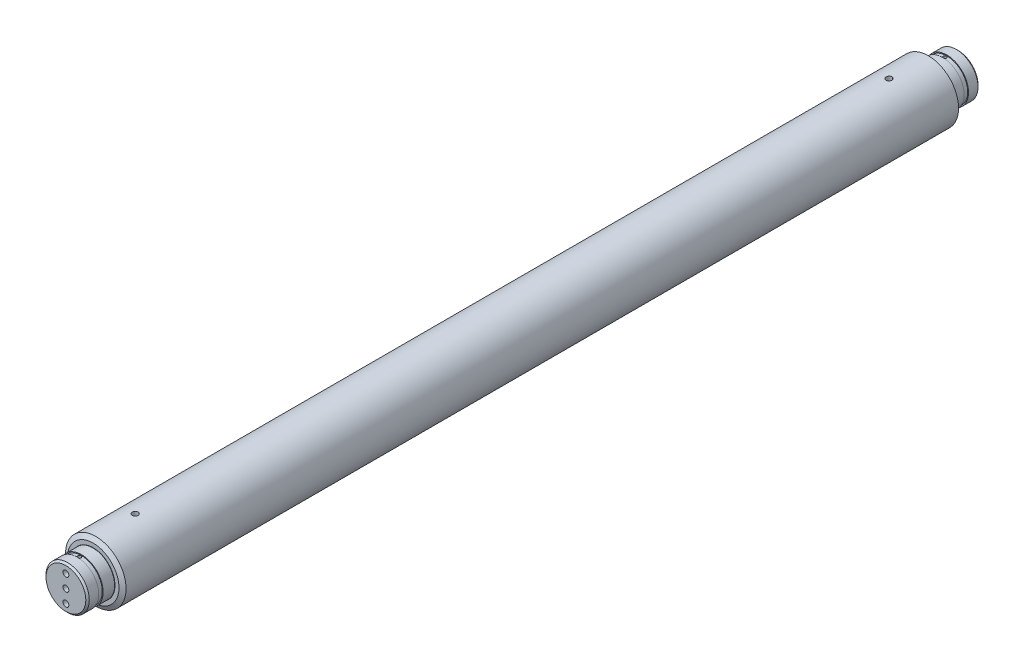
from build123d import *

# Parameters (mm, degrees)
ESQUISSE1_R                  = 35
EXTRUSION1_DEPTH             = 484
CHANFREIN1_SIZE              = 3
CHANFREIN1_SIZE2             = 5.196152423
CHANFREIN3_SIZE              = 3
CHANFREIN3_SIZE2             = 5.196152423
CHANFREIN2_SIZE              = 2
CHANFREIN2_OF_SYM_TRIE1_SIZE = 2
TROU_TARAUD_M82_REACH        = 523.407
TROU_TARAUD_M82_BORE_R       = 3.4
D_GAGEMENT_M3_51_REACH       = 523.407
D_GAGEMENT_M3_51_BORE_R      = 2
TROU_TARAUD_M83_AT_2_COUNT   = 2
TROU_TARAUD_M83_AT_2_PITCH   = 30
CONG_1_R                     = 0.2


with BuildPart() as part:
    # Esquisse1 → Extrusion1 (new, symmetric)
    with BuildSketch(Plane.XY):
        Circle(ESQUISSE1_R)
    extrude(amount=EXTRUSION1_DEPTH, both=True)

    # Chanfrein1
    chanfrein1_edges = [part.edges().sort_by_distance(p)[0] for p in [
        (-35, 0, 484),
    ]]
    chanfrein1_side = [part.faces().sort_by_distance(p)[0] for p in [
        (-35, 0, 0),
    ]]
    chamfer(chanfrein1_edges, length=CHANFREIN1_SIZE, length2=CHANFREIN1_SIZE2, reference=chanfrein1_side[0])

    # Chanfrein3
    chanfrein3_edges = [part.edges().sort_by_distance(p)[0] for p in [
        (-35, 0, -484),
    ]]
    chanfrein3_side = [part.faces().sort_by_distance(p)[0] for p in [
        (-35, 0, -1.5),
    ]]
    chamfer(chanfrein3_edges, length=CHANFREIN3_SIZE, length2=CHANFREIN3_SIZE2, reference=chanfrein3_side[0])

    # Esquisse2 → R_volution1 (revolve)
    with BuildSketch(Plane(origin=(0, 0, 0), x_dir=(0, 0, -1), z_dir=(1, 0, 0)), mode=Mode.PRIVATE) as r_volution1_sk:
        Polygon((-484, 25), (-497.5, 25), (-497.5, 24), (-502.5, 24), (-502.5, 25), (-515.5, 25), (-515.5, 0), (-484, 0), align=None)
    r_volution1 = revolve(r_volution1_sk.sketch.rotate(Axis((0, 0, 187.852900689), (0, 0, 1)), 90), axis=Axis((0, 0, 187.852900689), (0, 0, 1)))

    # Chanfrein2
    chanfrein2_edges = [part.edges().sort_by_distance(p)[0] for p in [
        (25, 0, 515.5),
    ]]
    chamfer(chanfrein2_edges, length=CHANFREIN2_SIZE)

    # Sym_trie1: R_volution1 across plane
    add(r_volution1.mirror(Plane.XY))

    # Chanfrein2 of Sym_trie1
    chanfrein2_of_sym_trie1_edges = [part.edges().sort_by_distance(p)[0] for p in [
        (25, 0, -515.5),
    ]]
    chamfer(chanfrein2_of_sym_trie1_edges, length=CHANFREIN2_OF_SYM_TRIE1_SIZE)

    # Esquisse3 → Trou taraud_ M81 (revolve, cut)
    with BuildSketch(Plane(origin=(0, 0, 515.5), x_dir=(0, -1, 0), z_dir=(1, 0, 0))):
        Polygon((0, 0), (0, 87.042926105), (3.4, 85), (3.4, 0), align=None)
    trou_taraud_m81 = revolve(axis=Axis((0, 0, 521.85), (0, 0, -1)), mode=Mode.SUBTRACT)

    # Trou taraud_ M82 bore → Trou taraud_ M82 (cut, up to next)
    with BuildSketch(Plane(origin=(0, 35, 0), x_dir=(-1, 0, 0), z_dir=(0, 1, 0)), mode=Mode.PRIVATE) as trou_taraud_m82_sk1:
        with Locations((0, 435.5)):
            Circle(TROU_TARAUD_M82_BORE_R)
    trou_taraud_m82_tool1 = extrude(trou_taraud_m82_sk1.sketch, amount=-TROU_TARAUD_M82_REACH, mode=Mode.PRIVATE) & part.part
    trou_taraud_m82 = trou_taraud_m82_tool1.solids().sort_by_distance((0, 35, 435.5))[0]
    add(trou_taraud_m82, mode=Mode.SUBTRACT)

    # D_gagement M3.51 bore → D_gagement M3.51 (cut, up to next)
    with BuildSketch(Plane(origin=(0, 35, 0), x_dir=(-1, 0, 0), z_dir=(0, 1, 0)), mode=Mode.PRIVATE) as d_gagement_m3_51_sk1:
        with Locations((0, 500)):
            Circle(D_GAGEMENT_M3_51_BORE_R)
    d_gagement_m3_51_tool1 = extrude(d_gagement_m3_51_sk1.sketch, amount=-D_GAGEMENT_M3_51_REACH, mode=Mode.PRIVATE) & part.part
    d_gagement_m3_51 = d_gagement_m3_51_tool1.solids().sort_by_distance((0, 35, 500))[0]
    add(d_gagement_m3_51, mode=Mode.SUBTRACT)

    # Sym_trie2: Trou taraud_ M81, Trou taraud_ M82, D_gagement M3.51 across plane
    add(trou_taraud_m81.mirror(Plane.XY), mode=Mode.SUBTRACT)
    add(trou_taraud_m82.mirror(Plane.XY), mode=Mode.SUBTRACT)
    add(d_gagement_m3_51.mirror(Plane.XY), mode=Mode.SUBTRACT)

    # Esquisse9 → Trou taraud_ M83 (revolve, cut)
    with BuildSketch(Plane(origin=(0, 15, 515.5), x_dir=(0, -1, 0), z_dir=(1, 0, 0))):
        Polygon((0, 0), (0, 21.792926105), (3.4, 19.75), (3.4, 0), align=None)
    trou_taraud_m83 = revolve(axis=Axis((0, 15, 521.85), (0, 0, -1)), mode=Mode.SUBTRACT)

    # Trou taraud_ M83 at 2: Trou taraud_ M83 ×2
    with Locations(*[(0, -i * TROU_TARAUD_M83_AT_2_PITCH, 0) for i in range(1, TROU_TARAUD_M83_AT_2_COUNT)]):
        add(trou_taraud_m83, mode=Mode.SUBTRACT)

    # Sym_trie3: Trou taraud_ M83 across plane
    add(trou_taraud_m83.mirror(Plane.XY), mode=Mode.SUBTRACT)

    # Sym_trie3 copy 1 sketch → Sym_trie3 copy 1 (revolve, cut)
    with BuildSketch(Plane(origin=(0, -15, -515.5), x_dir=(0, -1, 0), z_dir=(1, 0, 0))):
        Polygon((0, 0), (0, -21.792926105), (3.4, -19.75), (3.4, 0), align=None)
    revolve(axis=Axis((0, -15, -521.85), (0, 0, -1)), mode=Mode.SUBTRACT)

    # Cong_1
    cong_1_edges = [part.edges().sort_by_distance(p)[0] for p in [
        (25, 0, 484),
        (25, 0, -484),
    ]]
    fillet(cong_1_edges, radius=CONG_1_R)


solid = part.part
